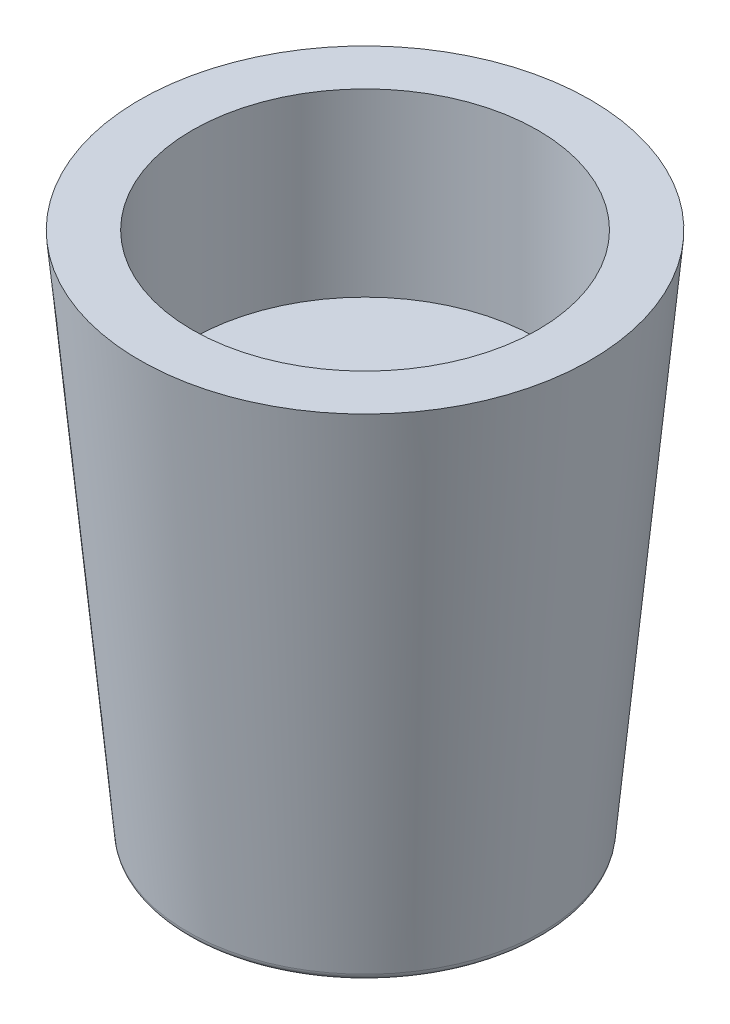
ISO-10303-21;
HEADER;
FILE_DESCRIPTION(('STEP AP214'),'2;1');
FILE_NAME('part.step','',(''),(''),'','','');
FILE_SCHEMA(('AUTOMOTIVE_DESIGN { 1 0 10303 214 1 1 1 1 }'));
ENDSEC;
DATA;
#1=APPLICATION_CONTEXT('core data for automotive mechanical design processes');
#2=APPLICATION_PROTOCOL_DEFINITION('international standard','automotive_design',2000,#1);
#3=PRODUCT_CONTEXT('',#1,'mechanical');
#4=PRODUCT('Part','Part','',(#3));
#5=PRODUCT_RELATED_PRODUCT_CATEGORY('part','',(#4));
#6=PRODUCT_DEFINITION_FORMATION('','',#4);
#7=PRODUCT_DEFINITION_CONTEXT('part definition',#1,'design');
#8=PRODUCT_DEFINITION('design','',#6,#7);
#9=PRODUCT_DEFINITION_SHAPE('','',#8);
#10=(LENGTH_UNIT() NAMED_UNIT(*) SI_UNIT(.MILLI.,.METRE.));
#11=(NAMED_UNIT(*) PLANE_ANGLE_UNIT() SI_UNIT($,.RADIAN.));
#12=(NAMED_UNIT(*) SI_UNIT($,.STERADIAN.) SOLID_ANGLE_UNIT());
#13=UNCERTAINTY_MEASURE_WITH_UNIT(LENGTH_MEASURE(1.E-05),#10,'distance_accuracy_value','');
#14=(GEOMETRIC_REPRESENTATION_CONTEXT(3) GLOBAL_UNCERTAINTY_ASSIGNED_CONTEXT((#13)) GLOBAL_UNIT_ASSIGNED_CONTEXT((#10,
#11,#12)) REPRESENTATION_CONTEXT('',''));
#15=CARTESIAN_POINT('',(0.,0.,0.));
#16=DIRECTION('',(0.,0.,1.));
#17=DIRECTION('',(1.,0.,0.));
#18=AXIS2_PLACEMENT_3D('',#15,#16,#17);
#19=CARTESIAN_POINT('',(23.5,0.,0.));
#20=DIRECTION('',(0.,-1.,0.));
#21=DIRECTION('',(0.,0.,-1.));
#22=AXIS2_PLACEMENT_3D('',#19,#20,#21);
#23=PLANE('',#22);
#24=CARTESIAN_POINT('',(0.,0.,0.));
#25=DIRECTION('',(0.,-1.,0.));
#26=DIRECTION('',(0.,0.,-1.));
#27=AXIS2_PLACEMENT_3D('',#24,#25,#26);
#28=CIRCLE('',#27,22.5885551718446);
#29=CARTESIAN_POINT('',(0.,0.,-22.5885551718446));
#30=VERTEX_POINT('',#29);
#31=EDGE_CURVE('E39',#30,#30,#28,.T.);
#32=ORIENTED_EDGE('',*,*,#31,.T.);
#33=EDGE_LOOP('',(#32));
#34=FACE_BOUND('',#33,.T.);
#35=ADVANCED_FACE('F32',(#34),#23,.T.);
#36=CARTESIAN_POINT('',(23.,46.,0.));
#37=DIRECTION('',(0.,1.,0.));
#38=DIRECTION('',(0.,0.,1.));
#39=AXIS2_PLACEMENT_3D('',#36,#37,#38);
#40=PLANE('',#39);
#41=CARTESIAN_POINT('',(0.,46.,0.));
#42=DIRECTION('',(0.,-1.,0.));
#43=DIRECTION('',(0.,0.,-1.));
#44=AXIS2_PLACEMENT_3D('',#41,#42,#43);
#45=CIRCLE('',#44,23.);
#46=CARTESIAN_POINT('',(0.,46.,-23.));
#47=VERTEX_POINT('',#46);
#48=EDGE_CURVE('E43',#47,#47,#45,.T.);
#49=ORIENTED_EDGE('',*,*,#48,.F.);
#50=EDGE_LOOP('',(#49));
#51=FACE_BOUND('',#50,.T.);
#52=ADVANCED_FACE('F68',(#51),#40,.T.);
#53=CARTESIAN_POINT('',(0.,0.,0.));
#54=DIRECTION('',(0.,-1.,0.));
#55=DIRECTION('',(0.,0.,-1.));
#56=AXIS2_PLACEMENT_3D('',#53,#54,#55);
#57=CYLINDRICAL_SURFACE('',#56,23.);
#58=ORIENTED_EDGE('',*,*,#48,.T.);
#59=EDGE_LOOP('',(#58));
#60=FACE_BOUND('',#59,.T.);
#61=CARTESIAN_POINT('',(0.,70.,0.));
#62=DIRECTION('',(0.,-1.,0.));
#63=DIRECTION('',(0.,0.,-1.));
#64=AXIS2_PLACEMENT_3D('',#61,#62,#63);
#65=CIRCLE('',#64,23.);
#66=CARTESIAN_POINT('',(0.,70.,-23.));
#67=VERTEX_POINT('',#66);
#68=EDGE_CURVE('E47',#67,#67,#65,.T.);
#69=ORIENTED_EDGE('',*,*,#68,.F.);
#70=EDGE_LOOP('',(#69));
#71=FACE_BOUND('',#70,.T.);
#72=ADVANCED_FACE('F60',(#60,#71),#57,.F.);
#73=CARTESIAN_POINT('',(30.,70.,0.));
#74=DIRECTION('',(0.,1.,0.));
#75=DIRECTION('',(0.,0.,1.));
#76=AXIS2_PLACEMENT_3D('',#73,#74,#75);
#77=PLANE('',#76);
#78=ORIENTED_EDGE('',*,*,#68,.T.);
#79=EDGE_LOOP('',(#78));
#80=FACE_BOUND('',#79,.T.);
#81=CARTESIAN_POINT('',(0.,70.,0.));
#82=DIRECTION('',(0.,-1.,0.));
#83=DIRECTION('',(0.,0.,-1.));
#84=AXIS2_PLACEMENT_3D('',#81,#82,#83);
#85=CIRCLE('',#84,30.);
#86=CARTESIAN_POINT('',(0.,70.,-30.));
#87=VERTEX_POINT('',#86);
#88=EDGE_CURVE('E52',#87,#87,#85,.T.);
#89=ORIENTED_EDGE('',*,*,#88,.F.);
#90=EDGE_LOOP('',(#89));
#91=FACE_BOUND('',#90,.T.);
#92=ADVANCED_FACE('F58',(#80,#91),#77,.T.);
#93=CARTESIAN_POINT('',(0.,0.,0.));
#94=DIRECTION('',(0.,1.,0.));
#95=DIRECTION('',(0.,0.,1.));
#96=AXIS2_PLACEMENT_3D('',#93,#94,#95);
#97=CONICAL_SURFACE('',#96,23.5,0.092591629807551);
#98=CARTESIAN_POINT('',(0.,0.907540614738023,0.));
#99=DIRECTION('',(0.,-1.,0.));
#100=DIRECTION('',(0.,0.,-1.));
#101=AXIS2_PLACEMENT_3D('',#98,#99,#100);
#102=CIRCLE('',#101,23.5842716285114);
#103=CARTESIAN_POINT('',(0.,0.907540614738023,-23.5842716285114));
#104=VERTEX_POINT('',#103);
#105=EDGE_CURVE('E10',#104,#104,#102,.F.);
#106=ORIENTED_EDGE('',*,*,#105,.T.);
#107=EDGE_LOOP('',(#106));
#108=FACE_BOUND('',#107,.T.);
#109=ORIENTED_EDGE('',*,*,#88,.T.);
#110=EDGE_LOOP('',(#109));
#111=FACE_BOUND('',#110,.T.);
#112=ADVANCED_FACE('F56',(#108,#111),#97,.T.);
#113=CARTESIAN_POINT('',(0.,1.,0.));
#114=DIRECTION('',(0.,-1.,0.));
#115=DIRECTION('',(0.,0.,-1.));
#116=AXIS2_PLACEMENT_3D('',#113,#114,#115);
#117=TOROIDAL_SURFACE('',#116,22.5885551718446,1.);
#118=ORIENTED_EDGE('',*,*,#105,.F.);
#119=EDGE_LOOP('',(#118));
#120=FACE_BOUND('',#119,.T.);
#121=ORIENTED_EDGE('',*,*,#31,.F.);
#122=EDGE_LOOP('',(#121));
#123=FACE_BOUND('',#122,.T.);
#124=ADVANCED_FACE('F34',(#120,#123),#117,.T.);
#125=CLOSED_SHELL('',(#35,#52,#72,#92,#112,#124));
#126=MANIFOLD_SOLID_BREP('B2',#125);
#127=ADVANCED_BREP_SHAPE_REPRESENTATION('',(#18,#126),#14);
#128=SHAPE_DEFINITION_REPRESENTATION(#9,#127);
ENDSEC;
END-ISO-10303-21;
